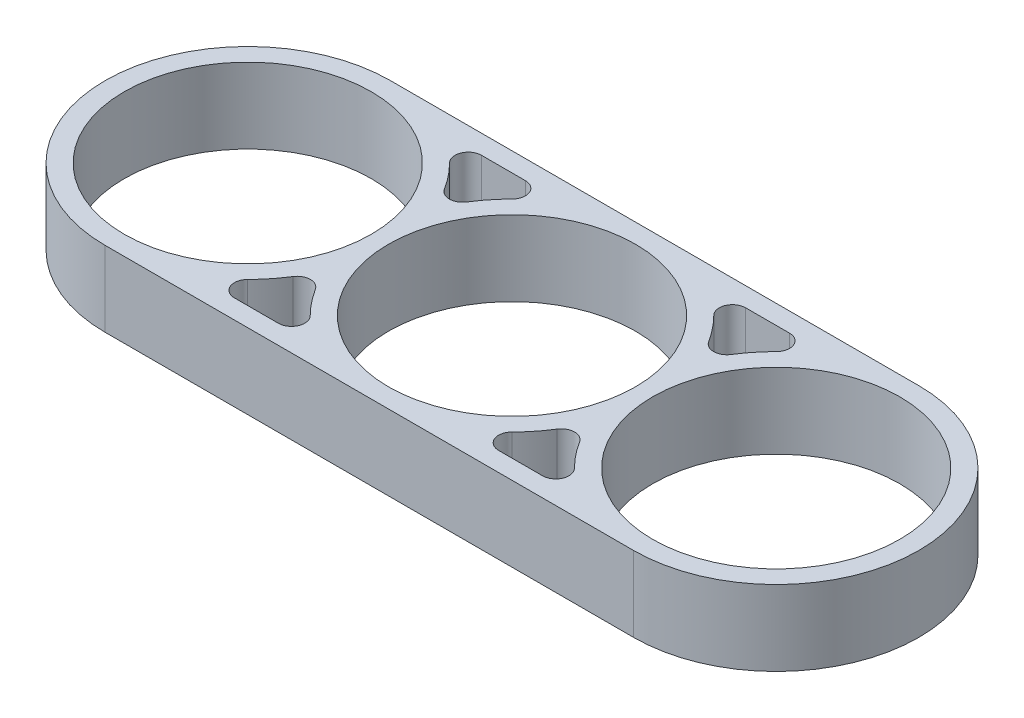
ISO-10303-21;
HEADER;
FILE_DESCRIPTION(('STEP AP214'),'2;1');
FILE_NAME('part.step','',(''),(''),'','','');
FILE_SCHEMA(('AUTOMOTIVE_DESIGN { 1 0 10303 214 1 1 1 1 }'));
ENDSEC;
DATA;
#1=APPLICATION_CONTEXT('core data for automotive mechanical design processes');
#2=APPLICATION_PROTOCOL_DEFINITION('international standard','automotive_design',2000,#1);
#3=PRODUCT_CONTEXT('',#1,'mechanical');
#4=PRODUCT('Part','Part','',(#3));
#5=PRODUCT_RELATED_PRODUCT_CATEGORY('part','',(#4));
#6=PRODUCT_DEFINITION_FORMATION('','',#4);
#7=PRODUCT_DEFINITION_CONTEXT('part definition',#1,'design');
#8=PRODUCT_DEFINITION('design','',#6,#7);
#9=PRODUCT_DEFINITION_SHAPE('','',#8);
#10=(LENGTH_UNIT() NAMED_UNIT(*) SI_UNIT(.MILLI.,.METRE.));
#11=(NAMED_UNIT(*) PLANE_ANGLE_UNIT() SI_UNIT($,.RADIAN.));
#12=(NAMED_UNIT(*) SI_UNIT($,.STERADIAN.) SOLID_ANGLE_UNIT());
#13=UNCERTAINTY_MEASURE_WITH_UNIT(LENGTH_MEASURE(1.E-05),#10,'distance_accuracy_value','');
#14=(GEOMETRIC_REPRESENTATION_CONTEXT(3) GLOBAL_UNCERTAINTY_ASSIGNED_CONTEXT((#13)) GLOBAL_UNIT_ASSIGNED_CONTEXT((#10,
#11,#12)) REPRESENTATION_CONTEXT('',''));
#15=CARTESIAN_POINT('',(0.,0.,0.));
#16=DIRECTION('',(0.,0.,1.));
#17=DIRECTION('',(1.,0.,0.));
#18=AXIS2_PLACEMENT_3D('',#15,#16,#17);
#19=CARTESIAN_POINT('',(-20.,5.7,0.));
#20=DIRECTION('',(0.,1.,0.));
#21=DIRECTION('',(0.,0.,1.));
#22=AXIS2_PLACEMENT_3D('',#19,#20,#21);
#23=PLANE('',#22);
#24=CARTESIAN_POINT('',(0.,5.7,0.));
#25=DIRECTION('',(0.,1.,0.));
#26=DIRECTION('',(0.,0.,1.));
#27=AXIS2_PLACEMENT_3D('',#24,#25,#26);
#28=CIRCLE('',#27,9.35);
#29=CARTESIAN_POINT('',(0.,5.7,9.35));
#30=VERTEX_POINT('',#29);
#31=EDGE_CURVE('E418',#30,#30,#28,.T.);
#32=ORIENTED_EDGE('',*,*,#31,.F.);
#33=EDGE_LOOP('',(#32));
#34=FACE_BOUND('',#33,.T.);
#35=CARTESIAN_POINT('',(-20.,5.7,0.));
#36=DIRECTION('',(0.,1.,0.));
#37=DIRECTION('',(0.,0.,1.));
#38=AXIS2_PLACEMENT_3D('',#35,#36,#37);
#39=CIRCLE('',#38,10.8);
#40=CARTESIAN_POINT('',(-20.,5.7,-10.8));
#41=VERTEX_POINT('',#40);
#42=CARTESIAN_POINT('',(-19.9999999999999,5.7,10.8));
#43=VERTEX_POINT('',#42);
#44=EDGE_CURVE('E430',#41,#43,#39,.T.);
#45=ORIENTED_EDGE('',*,*,#44,.T.);
#46=DIRECTION('',(1.,0.,0.));
#47=VECTOR('',#46,1.);
#48=CARTESIAN_POINT('',(-19.9999999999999,5.7,10.8));
#49=LINE('',#48,#47);
#50=CARTESIAN_POINT('',(20.0000000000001,5.7,10.8));
#51=VERTEX_POINT('',#50);
#52=EDGE_CURVE('E433',#43,#51,#49,.T.);
#53=ORIENTED_EDGE('',*,*,#52,.T.);
#54=CARTESIAN_POINT('',(20.,5.7,0.));
#55=DIRECTION('',(0.,1.,0.));
#56=DIRECTION('',(0.,0.,1.));
#57=AXIS2_PLACEMENT_3D('',#54,#55,#56);
#58=CIRCLE('',#57,10.8);
#59=CARTESIAN_POINT('',(20.,5.7,-10.8));
#60=VERTEX_POINT('',#59);
#61=EDGE_CURVE('E436',#51,#60,#58,.T.);
#62=ORIENTED_EDGE('',*,*,#61,.T.);
#63=DIRECTION('',(-1.,0.,0.));
#64=VECTOR('',#63,1.);
#65=CARTESIAN_POINT('',(-20.,5.7,-10.8));
#66=LINE('',#65,#64);
#67=EDGE_CURVE('E438',#60,#41,#66,.T.);
#68=ORIENTED_EDGE('',*,*,#67,.T.);
#69=EDGE_LOOP('',(#45,#53,#62,#68));
#70=FACE_BOUND('',#69,.T.);
#71=CARTESIAN_POINT('',(-20.,5.7,0.));
#72=DIRECTION('',(0.,1.,0.));
#73=DIRECTION('',(0.,0.,1.));
#74=AXIS2_PLACEMENT_3D('',#71,#72,#73);
#75=CIRCLE('',#74,9.35);
#76=CARTESIAN_POINT('',(-20.,5.7,9.35));
#77=VERTEX_POINT('',#76);
#78=EDGE_CURVE('E424',#77,#77,#75,.T.);
#79=ORIENTED_EDGE('',*,*,#78,.F.);
#80=EDGE_LOOP('',(#79));
#81=FACE_BOUND('',#80,.T.);
#82=CARTESIAN_POINT('',(20.,5.7,0.));
#83=DIRECTION('',(0.,1.,0.));
#84=DIRECTION('',(0.,0.,1.));
#85=AXIS2_PLACEMENT_3D('',#82,#83,#84);
#86=CIRCLE('',#85,9.34999999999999);
#87=CARTESIAN_POINT('',(20.,5.7,9.34999999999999));
#88=VERTEX_POINT('',#87);
#89=EDGE_CURVE('E412',#88,#88,#86,.T.);
#90=ORIENTED_EDGE('',*,*,#89,.F.);
#91=EDGE_LOOP('',(#90));
#92=FACE_BOUND('',#91,.T.);
#93=CARTESIAN_POINT('',(20.,5.7,0.));
#94=DIRECTION('',(0.,-1.,0.));
#95=DIRECTION('',(0.,0.,1.));
#96=AXIS2_PLACEMENT_3D('',#93,#94,#95);
#97=CIRCLE('',#96,10.8);
#98=CARTESIAN_POINT('',(12.3688705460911,5.7,7.64237288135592));
#99=VERTEX_POINT('',#98);
#100=CARTESIAN_POINT('',(10.8474576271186,5.7,5.73332086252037));
#101=VERTEX_POINT('',#100);
#102=EDGE_CURVE('E369',#99,#101,#97,.T.);
#103=ORIENTED_EDGE('',*,*,#102,.F.);
#104=CARTESIAN_POINT('',(11.662284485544,5.7,8.34999999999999));
#105=DIRECTION('',(0.,1.,0.));
#106=DIRECTION('',(0.,0.,1.));
#107=AXIS2_PLACEMENT_3D('',#104,#105,#106);
#108=CIRCLE('',#107,1.);
#109=CARTESIAN_POINT('',(11.662284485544,5.7,9.34999999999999));
#110=VERTEX_POINT('',#109);
#111=EDGE_CURVE('E367',#110,#99,#108,.T.);
#112=ORIENTED_EDGE('',*,*,#111,.F.);
#113=DIRECTION('',(1.,0.,0.));
#114=VECTOR('',#113,1.);
#115=CARTESIAN_POINT('',(8.33771551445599,5.7,9.34999999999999));
#116=LINE('',#115,#114);
#117=CARTESIAN_POINT('',(8.33771551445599,5.7,9.34999999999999));
#118=VERTEX_POINT('',#117);
#119=EDGE_CURVE('E379',#118,#110,#116,.T.);
#120=ORIENTED_EDGE('',*,*,#119,.F.);
#121=CARTESIAN_POINT('',(8.33771551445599,5.7,8.34999999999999));
#122=DIRECTION('',(0.,1.,0.));
#123=DIRECTION('',(0.,0.,-1.));
#124=AXIS2_PLACEMENT_3D('',#121,#122,#123);
#125=CIRCLE('',#124,1.);
#126=CARTESIAN_POINT('',(7.63112945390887,5.7,7.64237288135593));
#127=VERTEX_POINT('',#126);
#128=EDGE_CURVE('E376',#127,#118,#125,.T.);
#129=ORIENTED_EDGE('',*,*,#128,.F.);
#130=CARTESIAN_POINT('',(0.,5.7,0.));
#131=DIRECTION('',(0.,-1.,0.));
#132=DIRECTION('',(0.,0.,1.));
#133=AXIS2_PLACEMENT_3D('',#130,#131,#132);
#134=CIRCLE('',#133,10.8);
#135=CARTESIAN_POINT('',(9.15254237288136,5.7,5.73332086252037));
#136=VERTEX_POINT('',#135);
#137=EDGE_CURVE('E374',#136,#127,#134,.T.);
#138=ORIENTED_EDGE('',*,*,#137,.F.);
#139=CARTESIAN_POINT('',(10.,5.7,6.26418390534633));
#140=DIRECTION('',(0.,1.,0.));
#141=DIRECTION('',(0.,0.,1.));
#142=AXIS2_PLACEMENT_3D('',#139,#140,#141);
#143=CIRCLE('',#142,1.);
#144=EDGE_CURVE('E372',#101,#136,#143,.T.);
#145=ORIENTED_EDGE('',*,*,#144,.F.);
#146=EDGE_LOOP('',(#103,#112,#120,#129,#138,#145));
#147=FACE_BOUND('',#146,.T.);
#148=CARTESIAN_POINT('',(0.,5.7,0.));
#149=DIRECTION('',(0.,-1.,0.));
#150=DIRECTION('',(0.,0.,1.));
#151=AXIS2_PLACEMENT_3D('',#148,#149,#150);
#152=CIRCLE('',#151,10.8);
#153=CARTESIAN_POINT('',(-7.63112945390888,5.7,7.64237288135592));
#154=VERTEX_POINT('',#153);
#155=CARTESIAN_POINT('',(-9.15254237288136,5.7,5.73332086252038));
#156=VERTEX_POINT('',#155);
#157=EDGE_CURVE('E324',#154,#156,#152,.T.);
#158=ORIENTED_EDGE('',*,*,#157,.F.);
#159=CARTESIAN_POINT('',(-8.337715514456,5.7,8.34999999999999));
#160=DIRECTION('',(0.,1.,0.));
#161=DIRECTION('',(0.,0.,1.));
#162=AXIS2_PLACEMENT_3D('',#159,#160,#161);
#163=CIRCLE('',#162,1.);
#164=CARTESIAN_POINT('',(-8.337715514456,5.7,9.34999999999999));
#165=VERTEX_POINT('',#164);
#166=EDGE_CURVE('E322',#165,#154,#163,.T.);
#167=ORIENTED_EDGE('',*,*,#166,.F.);
#168=DIRECTION('',(1.,0.,0.));
#169=VECTOR('',#168,1.);
#170=CARTESIAN_POINT('',(-11.662284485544,5.7,9.35));
#171=LINE('',#170,#169);
#172=CARTESIAN_POINT('',(-11.662284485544,5.7,9.35));
#173=VERTEX_POINT('',#172);
#174=EDGE_CURVE('E334',#173,#165,#171,.T.);
#175=ORIENTED_EDGE('',*,*,#174,.F.);
#176=CARTESIAN_POINT('',(-11.662284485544,5.7,8.35));
#177=DIRECTION('',(0.,1.,0.));
#178=DIRECTION('',(0.,0.,-1.));
#179=AXIS2_PLACEMENT_3D('',#176,#177,#178);
#180=CIRCLE('',#179,1.);
#181=CARTESIAN_POINT('',(-12.3688705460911,5.7,7.64237288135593));
#182=VERTEX_POINT('',#181);
#183=EDGE_CURVE('E331',#182,#173,#180,.T.);
#184=ORIENTED_EDGE('',*,*,#183,.F.);
#185=CARTESIAN_POINT('',(-20.,5.7,0.));
#186=DIRECTION('',(0.,-1.,0.));
#187=DIRECTION('',(0.,0.,1.));
#188=AXIS2_PLACEMENT_3D('',#185,#186,#187);
#189=CIRCLE('',#188,10.8);
#190=CARTESIAN_POINT('',(-10.8474576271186,5.7,5.73332086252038));
#191=VERTEX_POINT('',#190);
#192=EDGE_CURVE('E329',#191,#182,#189,.T.);
#193=ORIENTED_EDGE('',*,*,#192,.F.);
#194=CARTESIAN_POINT('',(-10.,5.7,6.26418390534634));
#195=DIRECTION('',(0.,1.,0.));
#196=DIRECTION('',(0.,0.,-1.));
#197=AXIS2_PLACEMENT_3D('',#194,#195,#196);
#198=CIRCLE('',#197,1.);
#199=EDGE_CURVE('E327',#156,#191,#198,.T.);
#200=ORIENTED_EDGE('',*,*,#199,.F.);
#201=EDGE_LOOP('',(#158,#167,#175,#184,#193,#200));
#202=FACE_BOUND('',#201,.T.);
#203=CARTESIAN_POINT('',(20.,5.7,0.));
#204=DIRECTION('',(0.,-1.,0.));
#205=DIRECTION('',(0.,0.,1.));
#206=AXIS2_PLACEMENT_3D('',#203,#204,#205);
#207=CIRCLE('',#206,10.8);
#208=CARTESIAN_POINT('',(10.8474576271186,5.7,-5.73332086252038));
#209=VERTEX_POINT('',#208);
#210=CARTESIAN_POINT('',(12.3688705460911,5.7,-7.64237288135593));
#211=VERTEX_POINT('',#210);
#212=EDGE_CURVE('E279',#209,#211,#207,.T.);
#213=ORIENTED_EDGE('',*,*,#212,.F.);
#214=CARTESIAN_POINT('',(10.,5.7,-6.26418390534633));
#215=DIRECTION('',(0.,1.,0.));
#216=DIRECTION('',(0.,0.,-1.));
#217=AXIS2_PLACEMENT_3D('',#214,#215,#216);
#218=CIRCLE('',#217,1.);
#219=CARTESIAN_POINT('',(9.15254237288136,5.7,-5.73332086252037));
#220=VERTEX_POINT('',#219);
#221=EDGE_CURVE('E277',#220,#209,#218,.T.);
#222=ORIENTED_EDGE('',*,*,#221,.F.);
#223=CARTESIAN_POINT('',(0.,5.7,0.));
#224=DIRECTION('',(0.,-1.,0.));
#225=DIRECTION('',(0.,0.,1.));
#226=AXIS2_PLACEMENT_3D('',#223,#224,#225);
#227=CIRCLE('',#226,10.8);
#228=CARTESIAN_POINT('',(7.63112945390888,5.7,-7.64237288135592));
#229=VERTEX_POINT('',#228);
#230=EDGE_CURVE('E289',#229,#220,#227,.T.);
#231=ORIENTED_EDGE('',*,*,#230,.F.);
#232=CARTESIAN_POINT('',(8.337715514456,5.7,-8.34999999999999));
#233=DIRECTION('',(0.,1.,0.));
#234=DIRECTION('',(0.,0.,-1.));
#235=AXIS2_PLACEMENT_3D('',#232,#233,#234);
#236=CIRCLE('',#235,1.);
#237=CARTESIAN_POINT('',(8.337715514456,5.7,-9.34999999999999));
#238=VERTEX_POINT('',#237);
#239=EDGE_CURVE('E286',#238,#229,#236,.T.);
#240=ORIENTED_EDGE('',*,*,#239,.F.);
#241=DIRECTION('',(-1.,0.,0.));
#242=VECTOR('',#241,1.);
#243=CARTESIAN_POINT('',(8.337715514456,5.7,-9.34999999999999));
#244=LINE('',#243,#242);
#245=CARTESIAN_POINT('',(11.662284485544,5.7,-9.34999999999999));
#246=VERTEX_POINT('',#245);
#247=EDGE_CURVE('E284',#246,#238,#244,.T.);
#248=ORIENTED_EDGE('',*,*,#247,.F.);
#249=CARTESIAN_POINT('',(11.662284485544,5.7,-8.34999999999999));
#250=DIRECTION('',(0.,1.,0.));
#251=DIRECTION('',(0.,0.,1.));
#252=AXIS2_PLACEMENT_3D('',#249,#250,#251);
#253=CIRCLE('',#252,1.);
#254=EDGE_CURVE('E282',#211,#246,#253,.T.);
#255=ORIENTED_EDGE('',*,*,#254,.F.);
#256=EDGE_LOOP('',(#213,#222,#231,#240,#248,#255));
#257=FACE_BOUND('',#256,.T.);
#258=CARTESIAN_POINT('',(0.,5.7,0.));
#259=DIRECTION('',(0.,-1.,0.));
#260=DIRECTION('',(0.,0.,1.));
#261=AXIS2_PLACEMENT_3D('',#258,#259,#260);
#262=CIRCLE('',#261,10.8);
#263=CARTESIAN_POINT('',(-9.15254237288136,5.7,-5.73332086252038));
#264=VERTEX_POINT('',#263);
#265=CARTESIAN_POINT('',(-7.63112945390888,5.7,-7.64237288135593));
#266=VERTEX_POINT('',#265);
#267=EDGE_CURVE('E234',#264,#266,#262,.T.);
#268=ORIENTED_EDGE('',*,*,#267,.F.);
#269=CARTESIAN_POINT('',(-10.,5.7,-6.26418390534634));
#270=DIRECTION('',(0.,1.,0.));
#271=DIRECTION('',(0.,0.,-1.));
#272=AXIS2_PLACEMENT_3D('',#269,#270,#271);
#273=CIRCLE('',#272,1.);
#274=CARTESIAN_POINT('',(-10.8474576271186,5.7,-5.73332086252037));
#275=VERTEX_POINT('',#274);
#276=EDGE_CURVE('E226',#275,#264,#273,.T.);
#277=ORIENTED_EDGE('',*,*,#276,.F.);
#278=CARTESIAN_POINT('',(-20.,5.7,0.));
#279=DIRECTION('',(0.,-1.,0.));
#280=DIRECTION('',(0.,0.,1.));
#281=AXIS2_PLACEMENT_3D('',#278,#279,#280);
#282=CIRCLE('',#281,10.8);
#283=CARTESIAN_POINT('',(-12.3688705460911,5.7,-7.64237288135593));
#284=VERTEX_POINT('',#283);
#285=EDGE_CURVE('E255',#284,#275,#282,.T.);
#286=ORIENTED_EDGE('',*,*,#285,.F.);
#287=CARTESIAN_POINT('',(-11.662284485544,5.7,-8.35));
#288=DIRECTION('',(0.,1.,0.));
#289=DIRECTION('',(0.,0.,1.));
#290=AXIS2_PLACEMENT_3D('',#287,#288,#289);
#291=CIRCLE('',#290,1.);
#292=CARTESIAN_POINT('',(-11.662284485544,5.7,-9.35));
#293=VERTEX_POINT('',#292);
#294=EDGE_CURVE('E253',#293,#284,#291,.T.);
#295=ORIENTED_EDGE('',*,*,#294,.F.);
#296=DIRECTION('',(-1.,0.,0.));
#297=VECTOR('',#296,1.);
#298=CARTESIAN_POINT('',(-11.662284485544,5.7,-9.35));
#299=LINE('',#298,#297);
#300=CARTESIAN_POINT('',(-8.337715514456,5.7,-9.34999999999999));
#301=VERTEX_POINT('',#300);
#302=EDGE_CURVE('E249',#301,#293,#299,.T.);
#303=ORIENTED_EDGE('',*,*,#302,.F.);
#304=CARTESIAN_POINT('',(-8.337715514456,5.7,-8.34999999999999));
#305=DIRECTION('',(0.,1.,0.));
#306=DIRECTION('',(0.,0.,1.));
#307=AXIS2_PLACEMENT_3D('',#304,#305,#306);
#308=CIRCLE('',#307,1.);
#309=EDGE_CURVE('E247',#266,#301,#308,.T.);
#310=ORIENTED_EDGE('',*,*,#309,.F.);
#311=EDGE_LOOP('',(#268,#277,#286,#295,#303,#310));
#312=FACE_BOUND('',#311,.T.);
#313=ADVANCED_FACE('F41',(#34,#70,#81,#92,#147,#202,#257,#312),#23,.T.);
#314=CARTESIAN_POINT('',(-20.,0.,0.));
#315=DIRECTION('',(0.,1.,0.));
#316=DIRECTION('',(0.,0.,1.));
#317=AXIS2_PLACEMENT_3D('',#314,#315,#316);
#318=PLANE('',#317);
#319=CARTESIAN_POINT('',(10.,0.,-6.26418390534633));
#320=DIRECTION('',(0.,1.,0.));
#321=DIRECTION('',(0.,0.,-1.));
#322=AXIS2_PLACEMENT_3D('',#319,#320,#321);
#323=CIRCLE('',#322,1.);
#324=CARTESIAN_POINT('',(9.15254237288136,0.,-5.73332086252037));
#325=VERTEX_POINT('',#324);
#326=CARTESIAN_POINT('',(10.8474576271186,0.,-5.73332086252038));
#327=VERTEX_POINT('',#326);
#328=EDGE_CURVE('E242',#325,#327,#323,.T.);
#329=ORIENTED_EDGE('',*,*,#328,.T.);
#330=CARTESIAN_POINT('',(20.,0.,0.));
#331=DIRECTION('',(0.,-1.,0.));
#332=DIRECTION('',(0.,0.,1.));
#333=AXIS2_PLACEMENT_3D('',#330,#331,#332);
#334=CIRCLE('',#333,10.8);
#335=CARTESIAN_POINT('',(12.3688705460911,0.,-7.64237288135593));
#336=VERTEX_POINT('',#335);
#337=EDGE_CURVE('E294',#327,#336,#334,.T.);
#338=ORIENTED_EDGE('',*,*,#337,.T.);
#339=CARTESIAN_POINT('',(11.662284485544,0.,-8.34999999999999));
#340=DIRECTION('',(0.,1.,0.));
#341=DIRECTION('',(0.,0.,1.));
#342=AXIS2_PLACEMENT_3D('',#339,#340,#341);
#343=CIRCLE('',#342,1.);
#344=CARTESIAN_POINT('',(11.662284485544,0.,-9.34999999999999));
#345=VERTEX_POINT('',#344);
#346=EDGE_CURVE('E297',#336,#345,#343,.T.);
#347=ORIENTED_EDGE('',*,*,#346,.T.);
#348=DIRECTION('',(-1.,0.,0.));
#349=VECTOR('',#348,1.);
#350=CARTESIAN_POINT('',(8.337715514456,0.,-9.34999999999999));
#351=LINE('',#350,#349);
#352=CARTESIAN_POINT('',(8.337715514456,0.,-9.34999999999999));
#353=VERTEX_POINT('',#352);
#354=EDGE_CURVE('E300',#345,#353,#351,.T.);
#355=ORIENTED_EDGE('',*,*,#354,.T.);
#356=CARTESIAN_POINT('',(8.337715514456,0.,-8.34999999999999));
#357=DIRECTION('',(0.,1.,0.));
#358=DIRECTION('',(0.,0.,-1.));
#359=AXIS2_PLACEMENT_3D('',#356,#357,#358);
#360=CIRCLE('',#359,1.);
#361=CARTESIAN_POINT('',(7.63112945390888,0.,-7.64237288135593));
#362=VERTEX_POINT('',#361);
#363=EDGE_CURVE('E303',#353,#362,#360,.T.);
#364=ORIENTED_EDGE('',*,*,#363,.T.);
#365=CARTESIAN_POINT('',(0.,0.,0.));
#366=DIRECTION('',(0.,-1.,0.));
#367=DIRECTION('',(0.,0.,1.));
#368=AXIS2_PLACEMENT_3D('',#365,#366,#367);
#369=CIRCLE('',#368,10.8);
#370=EDGE_CURVE('E280',#362,#325,#369,.T.);
#371=ORIENTED_EDGE('',*,*,#370,.T.);
#372=EDGE_LOOP('',(#329,#338,#347,#355,#364,#371));
#373=FACE_BOUND('',#372,.T.);
#374=CARTESIAN_POINT('',(11.662284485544,0.,8.34999999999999));
#375=DIRECTION('',(0.,1.,0.));
#376=DIRECTION('',(0.,0.,1.));
#377=AXIS2_PLACEMENT_3D('',#374,#375,#376);
#378=CIRCLE('',#377,1.);
#379=CARTESIAN_POINT('',(11.662284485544,0.,9.34999999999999));
#380=VERTEX_POINT('',#379);
#381=CARTESIAN_POINT('',(12.3688705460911,0.,7.64237288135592));
#382=VERTEX_POINT('',#381);
#383=EDGE_CURVE('E366',#380,#382,#378,.T.);
#384=ORIENTED_EDGE('',*,*,#383,.T.);
#385=CARTESIAN_POINT('',(20.,0.,0.));
#386=DIRECTION('',(0.,-1.,0.));
#387=DIRECTION('',(0.,0.,1.));
#388=AXIS2_PLACEMENT_3D('',#385,#386,#387);
#389=CIRCLE('',#388,10.8);
#390=CARTESIAN_POINT('',(10.8474576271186,0.,5.73332086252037));
#391=VERTEX_POINT('',#390);
#392=EDGE_CURVE('E384',#382,#391,#389,.T.);
#393=ORIENTED_EDGE('',*,*,#392,.T.);
#394=CARTESIAN_POINT('',(10.,0.,6.26418390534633));
#395=DIRECTION('',(0.,1.,0.));
#396=DIRECTION('',(0.,0.,1.));
#397=AXIS2_PLACEMENT_3D('',#394,#395,#396);
#398=CIRCLE('',#397,1.);
#399=CARTESIAN_POINT('',(9.15254237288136,0.,5.73332086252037));
#400=VERTEX_POINT('',#399);
#401=EDGE_CURVE('E387',#391,#400,#398,.T.);
#402=ORIENTED_EDGE('',*,*,#401,.T.);
#403=CARTESIAN_POINT('',(0.,0.,0.));
#404=DIRECTION('',(0.,-1.,0.));
#405=DIRECTION('',(0.,0.,1.));
#406=AXIS2_PLACEMENT_3D('',#403,#404,#405);
#407=CIRCLE('',#406,10.8);
#408=CARTESIAN_POINT('',(7.63112945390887,0.,7.64237288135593));
#409=VERTEX_POINT('',#408);
#410=EDGE_CURVE('E390',#400,#409,#407,.T.);
#411=ORIENTED_EDGE('',*,*,#410,.T.);
#412=CARTESIAN_POINT('',(8.33771551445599,0.,8.34999999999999));
#413=DIRECTION('',(0.,1.,0.));
#414=DIRECTION('',(0.,0.,-1.));
#415=AXIS2_PLACEMENT_3D('',#412,#413,#414);
#416=CIRCLE('',#415,1.);
#417=CARTESIAN_POINT('',(8.33771551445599,0.,9.34999999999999));
#418=VERTEX_POINT('',#417);
#419=EDGE_CURVE('E393',#409,#418,#416,.T.);
#420=ORIENTED_EDGE('',*,*,#419,.T.);
#421=DIRECTION('',(1.,0.,0.));
#422=VECTOR('',#421,1.);
#423=CARTESIAN_POINT('',(8.33771551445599,0.,9.34999999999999));
#424=LINE('',#423,#422);
#425=EDGE_CURVE('E370',#418,#380,#424,.T.);
#426=ORIENTED_EDGE('',*,*,#425,.T.);
#427=EDGE_LOOP('',(#384,#393,#402,#411,#420,#426));
#428=FACE_BOUND('',#427,.T.);
#429=CARTESIAN_POINT('',(-20.,0.,0.));
#430=DIRECTION('',(0.,1.,0.));
#431=DIRECTION('',(0.,0.,1.));
#432=AXIS2_PLACEMENT_3D('',#429,#430,#431);
#433=CIRCLE('',#432,10.8);
#434=CARTESIAN_POINT('',(-20.,0.,-10.8));
#435=VERTEX_POINT('',#434);
#436=CARTESIAN_POINT('',(-19.9999999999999,0.,10.8));
#437=VERTEX_POINT('',#436);
#438=EDGE_CURVE('E427',#435,#437,#433,.T.);
#439=ORIENTED_EDGE('',*,*,#438,.F.);
#440=DIRECTION('',(-1.,0.,0.));
#441=VECTOR('',#440,1.);
#442=CARTESIAN_POINT('',(-20.,0.,-10.8));
#443=LINE('',#442,#441);
#444=CARTESIAN_POINT('',(20.,0.,-10.8));
#445=VERTEX_POINT('',#444);
#446=EDGE_CURVE('E434',#445,#435,#443,.T.);
#447=ORIENTED_EDGE('',*,*,#446,.F.);
#448=CARTESIAN_POINT('',(20.,0.,0.));
#449=DIRECTION('',(0.,1.,0.));
#450=DIRECTION('',(0.,0.,1.));
#451=AXIS2_PLACEMENT_3D('',#448,#449,#450);
#452=CIRCLE('',#451,10.8);
#453=CARTESIAN_POINT('',(20.0000000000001,0.,10.8));
#454=VERTEX_POINT('',#453);
#455=EDGE_CURVE('E445',#454,#445,#452,.T.);
#456=ORIENTED_EDGE('',*,*,#455,.F.);
#457=DIRECTION('',(1.,0.,0.));
#458=VECTOR('',#457,1.);
#459=CARTESIAN_POINT('',(-19.9999999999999,0.,10.8));
#460=LINE('',#459,#458);
#461=EDGE_CURVE('E443',#437,#454,#460,.T.);
#462=ORIENTED_EDGE('',*,*,#461,.F.);
#463=EDGE_LOOP('',(#439,#447,#456,#462));
#464=FACE_BOUND('',#463,.T.);
#465=CARTESIAN_POINT('',(-20.,0.,0.));
#466=DIRECTION('',(0.,1.,0.));
#467=DIRECTION('',(0.,0.,1.));
#468=AXIS2_PLACEMENT_3D('',#465,#466,#467);
#469=CIRCLE('',#468,9.35);
#470=CARTESIAN_POINT('',(-20.,0.,9.35));
#471=VERTEX_POINT('',#470);
#472=EDGE_CURVE('E421',#471,#471,#469,.T.);
#473=ORIENTED_EDGE('',*,*,#472,.T.);
#474=EDGE_LOOP('',(#473));
#475=FACE_BOUND('',#474,.T.);
#476=CARTESIAN_POINT('',(0.,0.,0.));
#477=DIRECTION('',(0.,1.,0.));
#478=DIRECTION('',(0.,0.,1.));
#479=AXIS2_PLACEMENT_3D('',#476,#477,#478);
#480=CIRCLE('',#479,9.35);
#481=CARTESIAN_POINT('',(0.,0.,9.35));
#482=VERTEX_POINT('',#481);
#483=EDGE_CURVE('E415',#482,#482,#480,.T.);
#484=ORIENTED_EDGE('',*,*,#483,.T.);
#485=EDGE_LOOP('',(#484));
#486=FACE_BOUND('',#485,.T.);
#487=CARTESIAN_POINT('',(20.,0.,0.));
#488=DIRECTION('',(0.,1.,0.));
#489=DIRECTION('',(0.,0.,1.));
#490=AXIS2_PLACEMENT_3D('',#487,#488,#489);
#491=CIRCLE('',#490,9.34999999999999);
#492=CARTESIAN_POINT('',(20.,0.,9.34999999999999));
#493=VERTEX_POINT('',#492);
#494=EDGE_CURVE('E411',#493,#493,#491,.T.);
#495=ORIENTED_EDGE('',*,*,#494,.T.);
#496=EDGE_LOOP('',(#495));
#497=FACE_BOUND('',#496,.T.);
#498=CARTESIAN_POINT('',(-8.337715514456,0.,8.34999999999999));
#499=DIRECTION('',(0.,1.,0.));
#500=DIRECTION('',(0.,0.,1.));
#501=AXIS2_PLACEMENT_3D('',#498,#499,#500);
#502=CIRCLE('',#501,1.);
#503=CARTESIAN_POINT('',(-8.337715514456,0.,9.34999999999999));
#504=VERTEX_POINT('',#503);
#505=CARTESIAN_POINT('',(-7.63112945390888,0.,7.64237288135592));
#506=VERTEX_POINT('',#505);
#507=EDGE_CURVE('E321',#504,#506,#502,.T.);
#508=ORIENTED_EDGE('',*,*,#507,.T.);
#509=CARTESIAN_POINT('',(0.,0.,0.));
#510=DIRECTION('',(0.,-1.,0.));
#511=DIRECTION('',(0.,0.,1.));
#512=AXIS2_PLACEMENT_3D('',#509,#510,#511);
#513=CIRCLE('',#512,10.8);
#514=CARTESIAN_POINT('',(-9.15254237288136,0.,5.73332086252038));
#515=VERTEX_POINT('',#514);
#516=EDGE_CURVE('E339',#506,#515,#513,.T.);
#517=ORIENTED_EDGE('',*,*,#516,.T.);
#518=CARTESIAN_POINT('',(-10.,0.,6.26418390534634));
#519=DIRECTION('',(0.,1.,0.));
#520=DIRECTION('',(0.,0.,-1.));
#521=AXIS2_PLACEMENT_3D('',#518,#519,#520);
#522=CIRCLE('',#521,1.);
#523=CARTESIAN_POINT('',(-10.8474576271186,0.,5.73332086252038));
#524=VERTEX_POINT('',#523);
#525=EDGE_CURVE('E342',#515,#524,#522,.T.);
#526=ORIENTED_EDGE('',*,*,#525,.T.);
#527=CARTESIAN_POINT('',(-20.,0.,0.));
#528=DIRECTION('',(0.,-1.,0.));
#529=DIRECTION('',(0.,0.,1.));
#530=AXIS2_PLACEMENT_3D('',#527,#528,#529);
#531=CIRCLE('',#530,10.8);
#532=CARTESIAN_POINT('',(-12.3688705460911,0.,7.64237288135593));
#533=VERTEX_POINT('',#532);
#534=EDGE_CURVE('E345',#524,#533,#531,.T.);
#535=ORIENTED_EDGE('',*,*,#534,.T.);
#536=CARTESIAN_POINT('',(-11.662284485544,0.,8.35));
#537=DIRECTION('',(0.,1.,0.));
#538=DIRECTION('',(0.,0.,-1.));
#539=AXIS2_PLACEMENT_3D('',#536,#537,#538);
#540=CIRCLE('',#539,1.);
#541=CARTESIAN_POINT('',(-11.662284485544,0.,9.35));
#542=VERTEX_POINT('',#541);
#543=EDGE_CURVE('E348',#533,#542,#540,.T.);
#544=ORIENTED_EDGE('',*,*,#543,.T.);
#545=DIRECTION('',(1.,0.,0.));
#546=VECTOR('',#545,1.);
#547=CARTESIAN_POINT('',(-11.662284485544,0.,9.35));
#548=LINE('',#547,#546);
#549=EDGE_CURVE('E325',#542,#504,#548,.T.);
#550=ORIENTED_EDGE('',*,*,#549,.T.);
#551=EDGE_LOOP('',(#508,#517,#526,#535,#544,#550));
#552=FACE_BOUND('',#551,.T.);
#553=CARTESIAN_POINT('',(-10.,0.,-6.26418390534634));
#554=DIRECTION('',(0.,1.,0.));
#555=DIRECTION('',(0.,0.,-1.));
#556=AXIS2_PLACEMENT_3D('',#553,#554,#555);
#557=CIRCLE('',#556,1.);
#558=CARTESIAN_POINT('',(-10.8474576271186,0.,-5.73332086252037));
#559=VERTEX_POINT('',#558);
#560=CARTESIAN_POINT('',(-9.15254237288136,0.,-5.73332086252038));
#561=VERTEX_POINT('',#560);
#562=EDGE_CURVE('E64',#559,#561,#557,.T.);
#563=ORIENTED_EDGE('',*,*,#562,.T.);
#564=CARTESIAN_POINT('',(0.,0.,0.));
#565=DIRECTION('',(0.,-1.,0.));
#566=DIRECTION('',(0.,0.,1.));
#567=AXIS2_PLACEMENT_3D('',#564,#565,#566);
#568=CIRCLE('',#567,10.8);
#569=CARTESIAN_POINT('',(-7.63112945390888,0.,-7.64237288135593));
#570=VERTEX_POINT('',#569);
#571=EDGE_CURVE('E241',#561,#570,#568,.T.);
#572=ORIENTED_EDGE('',*,*,#571,.T.);
#573=CARTESIAN_POINT('',(-8.337715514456,0.,-8.34999999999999));
#574=DIRECTION('',(0.,1.,0.));
#575=DIRECTION('',(0.,0.,1.));
#576=AXIS2_PLACEMENT_3D('',#573,#574,#575);
#577=CIRCLE('',#576,1.);
#578=CARTESIAN_POINT('',(-8.337715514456,0.,-9.34999999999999));
#579=VERTEX_POINT('',#578);
#580=EDGE_CURVE('E259',#570,#579,#577,.T.);
#581=ORIENTED_EDGE('',*,*,#580,.T.);
#582=DIRECTION('',(-1.,0.,0.));
#583=VECTOR('',#582,1.);
#584=CARTESIAN_POINT('',(-11.662284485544,0.,-9.35));
#585=LINE('',#584,#583);
#586=CARTESIAN_POINT('',(-11.662284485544,0.,-9.35));
#587=VERTEX_POINT('',#586);
#588=EDGE_CURVE('E262',#579,#587,#585,.T.);
#589=ORIENTED_EDGE('',*,*,#588,.T.);
#590=CARTESIAN_POINT('',(-11.662284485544,0.,-8.35));
#591=DIRECTION('',(0.,1.,0.));
#592=DIRECTION('',(0.,0.,1.));
#593=AXIS2_PLACEMENT_3D('',#590,#591,#592);
#594=CIRCLE('',#593,1.);
#595=CARTESIAN_POINT('',(-12.3688705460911,0.,-7.64237288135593));
#596=VERTEX_POINT('',#595);
#597=EDGE_CURVE('E265',#587,#596,#594,.T.);
#598=ORIENTED_EDGE('',*,*,#597,.T.);
#599=CARTESIAN_POINT('',(-20.,0.,0.));
#600=DIRECTION('',(0.,-1.,0.));
#601=DIRECTION('',(0.,0.,1.));
#602=AXIS2_PLACEMENT_3D('',#599,#600,#601);
#603=CIRCLE('',#602,10.8);
#604=EDGE_CURVE('E235',#596,#559,#603,.T.);
#605=ORIENTED_EDGE('',*,*,#604,.T.);
#606=EDGE_LOOP('',(#563,#572,#581,#589,#598,#605));
#607=FACE_BOUND('',#606,.T.);
#608=ADVANCED_FACE('F463',(#373,#428,#464,#475,#486,#497,#552,#607),#318,.F.);
#609=CARTESIAN_POINT('',(-20.,5.7,0.));
#610=DIRECTION('',(0.,-1.,0.));
#611=DIRECTION('',(0.,0.,-1.));
#612=AXIS2_PLACEMENT_3D('',#609,#610,#611);
#613=CYLINDRICAL_SURFACE('',#612,10.8);
#614=ORIENTED_EDGE('',*,*,#438,.T.);
#615=DIRECTION('',(0.,-1.,0.));
#616=VECTOR('',#615,1.);
#617=CARTESIAN_POINT('',(-19.9999999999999,5.7,10.8));
#618=LINE('',#617,#616);
#619=EDGE_CURVE('E11',#43,#437,#618,.T.);
#620=ORIENTED_EDGE('',*,*,#619,.F.);
#621=ORIENTED_EDGE('',*,*,#44,.F.);
#622=DIRECTION('',(0.,-1.,0.));
#623=VECTOR('',#622,1.);
#624=CARTESIAN_POINT('',(-20.,5.7,-10.8));
#625=LINE('',#624,#623);
#626=EDGE_CURVE('E440',#41,#435,#625,.T.);
#627=ORIENTED_EDGE('',*,*,#626,.T.);
#628=EDGE_LOOP('',(#614,#620,#621,#627));
#629=FACE_BOUND('',#628,.T.);
#630=ADVANCED_FACE('F43',(#629),#613,.T.);
#631=CARTESIAN_POINT('',(-19.9999999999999,5.7,10.8));
#632=DIRECTION('',(0.,0.,-1.));
#633=DIRECTION('',(-1.,0.,0.));
#634=AXIS2_PLACEMENT_3D('',#631,#632,#633);
#635=PLANE('',#634);
#636=ORIENTED_EDGE('',*,*,#461,.T.);
#637=DIRECTION('',(0.,-1.,0.));
#638=VECTOR('',#637,1.);
#639=CARTESIAN_POINT('',(20.0000000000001,5.7,10.8));
#640=LINE('',#639,#638);
#641=EDGE_CURVE('E49',#51,#454,#640,.T.);
#642=ORIENTED_EDGE('',*,*,#641,.F.);
#643=ORIENTED_EDGE('',*,*,#52,.F.);
#644=ORIENTED_EDGE('',*,*,#619,.T.);
#645=EDGE_LOOP('',(#636,#642,#643,#644));
#646=FACE_BOUND('',#645,.T.);
#647=ADVANCED_FACE('F474',(#646),#635,.F.);
#648=CARTESIAN_POINT('',(20.,5.7,0.));
#649=DIRECTION('',(0.,-1.,0.));
#650=DIRECTION('',(0.,0.,-1.));
#651=AXIS2_PLACEMENT_3D('',#648,#649,#650);
#652=CYLINDRICAL_SURFACE('',#651,10.8);
#653=ORIENTED_EDGE('',*,*,#455,.T.);
#654=DIRECTION('',(0.,-1.,0.));
#655=VECTOR('',#654,1.);
#656=CARTESIAN_POINT('',(20.,5.7,-10.8));
#657=LINE('',#656,#655);
#658=EDGE_CURVE('E450',#60,#445,#657,.T.);
#659=ORIENTED_EDGE('',*,*,#658,.F.);
#660=ORIENTED_EDGE('',*,*,#61,.F.);
#661=ORIENTED_EDGE('',*,*,#641,.T.);
#662=EDGE_LOOP('',(#653,#659,#660,#661));
#663=FACE_BOUND('',#662,.T.);
#664=ADVANCED_FACE('F457',(#663),#652,.T.);
#665=CARTESIAN_POINT('',(-20.,5.7,-10.8));
#666=DIRECTION('',(0.,0.,1.));
#667=DIRECTION('',(1.,0.,0.));
#668=AXIS2_PLACEMENT_3D('',#665,#666,#667);
#669=PLANE('',#668);
#670=ORIENTED_EDGE('',*,*,#446,.T.);
#671=ORIENTED_EDGE('',*,*,#626,.F.);
#672=ORIENTED_EDGE('',*,*,#67,.F.);
#673=ORIENTED_EDGE('',*,*,#658,.T.);
#674=EDGE_LOOP('',(#670,#671,#672,#673));
#675=FACE_BOUND('',#674,.T.);
#676=ADVANCED_FACE('F467',(#675),#669,.F.);
#677=CARTESIAN_POINT('',(-20.,5.7,0.));
#678=DIRECTION('',(0.,-1.,0.));
#679=DIRECTION('',(0.,0.,-1.));
#680=AXIS2_PLACEMENT_3D('',#677,#678,#679);
#681=CYLINDRICAL_SURFACE('',#680,9.35);
#682=ORIENTED_EDGE('',*,*,#78,.T.);
#683=EDGE_LOOP('',(#682));
#684=FACE_BOUND('',#683,.T.);
#685=ORIENTED_EDGE('',*,*,#472,.F.);
#686=EDGE_LOOP('',(#685));
#687=FACE_BOUND('',#686,.T.);
#688=ADVANCED_FACE('F491',(#684,#687),#681,.F.);
#689=CARTESIAN_POINT('',(0.,5.7,0.));
#690=DIRECTION('',(0.,-1.,0.));
#691=DIRECTION('',(0.,0.,-1.));
#692=AXIS2_PLACEMENT_3D('',#689,#690,#691);
#693=CYLINDRICAL_SURFACE('',#692,9.35);
#694=ORIENTED_EDGE('',*,*,#31,.T.);
#695=EDGE_LOOP('',(#694));
#696=FACE_BOUND('',#695,.T.);
#697=ORIENTED_EDGE('',*,*,#483,.F.);
#698=EDGE_LOOP('',(#697));
#699=FACE_BOUND('',#698,.T.);
#700=ADVANCED_FACE('F498',(#696,#699),#693,.F.);
#701=CARTESIAN_POINT('',(20.,5.7,0.));
#702=DIRECTION('',(0.,-1.,0.));
#703=DIRECTION('',(0.,0.,-1.));
#704=AXIS2_PLACEMENT_3D('',#701,#702,#703);
#705=CYLINDRICAL_SURFACE('',#704,9.34999999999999);
#706=ORIENTED_EDGE('',*,*,#89,.T.);
#707=EDGE_LOOP('',(#706));
#708=FACE_BOUND('',#707,.T.);
#709=ORIENTED_EDGE('',*,*,#494,.F.);
#710=EDGE_LOOP('',(#709));
#711=FACE_BOUND('',#710,.T.);
#712=ADVANCED_FACE('F503',(#708,#711),#705,.F.);
#713=CARTESIAN_POINT('',(11.662284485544,5.7,8.34999999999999));
#714=DIRECTION('',(0.,-1.,0.));
#715=DIRECTION('',(0.,0.,-1.));
#716=AXIS2_PLACEMENT_3D('',#713,#714,#715);
#717=CYLINDRICAL_SURFACE('',#716,1.);
#718=ORIENTED_EDGE('',*,*,#383,.F.);
#719=DIRECTION('',(0.,-1.,0.));
#720=VECTOR('',#719,1.);
#721=CARTESIAN_POINT('',(11.662284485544,5.7,9.34999999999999));
#722=LINE('',#721,#720);
#723=EDGE_CURVE('E381',#110,#380,#722,.T.);
#724=ORIENTED_EDGE('',*,*,#723,.F.);
#725=ORIENTED_EDGE('',*,*,#111,.T.);
#726=DIRECTION('',(0.,-1.,0.));
#727=VECTOR('',#726,1.);
#728=CARTESIAN_POINT('',(12.3688705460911,5.7,7.64237288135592));
#729=LINE('',#728,#727);
#730=EDGE_CURVE('E408',#99,#382,#729,.T.);
#731=ORIENTED_EDGE('',*,*,#730,.T.);
#732=EDGE_LOOP('',(#718,#724,#725,#731));
#733=FACE_BOUND('',#732,.T.);
#734=ADVANCED_FACE('F606',(#733),#717,.F.);
#735=CARTESIAN_POINT('',(20.,5.7,0.));
#736=DIRECTION('',(0.,-1.,0.));
#737=DIRECTION('',(0.,0.,-1.));
#738=AXIS2_PLACEMENT_3D('',#735,#736,#737);
#739=CYLINDRICAL_SURFACE('',#738,10.8);
#740=ORIENTED_EDGE('',*,*,#392,.F.);
#741=ORIENTED_EDGE('',*,*,#730,.F.);
#742=ORIENTED_EDGE('',*,*,#102,.T.);
#743=DIRECTION('',(0.,-1.,0.));
#744=VECTOR('',#743,1.);
#745=CARTESIAN_POINT('',(10.8474576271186,5.7,5.73332086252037));
#746=LINE('',#745,#744);
#747=EDGE_CURVE('E406',#101,#391,#746,.T.);
#748=ORIENTED_EDGE('',*,*,#747,.T.);
#749=EDGE_LOOP('',(#740,#741,#742,#748));
#750=FACE_BOUND('',#749,.T.);
#751=ADVANCED_FACE('F602',(#750),#739,.T.);
#752=CARTESIAN_POINT('',(10.,5.7,6.26418390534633));
#753=DIRECTION('',(0.,-1.,0.));
#754=DIRECTION('',(0.,0.,-1.));
#755=AXIS2_PLACEMENT_3D('',#752,#753,#754);
#756=CYLINDRICAL_SURFACE('',#755,1.);
#757=ORIENTED_EDGE('',*,*,#401,.F.);
#758=ORIENTED_EDGE('',*,*,#747,.F.);
#759=ORIENTED_EDGE('',*,*,#144,.T.);
#760=DIRECTION('',(0.,-1.,0.));
#761=VECTOR('',#760,1.);
#762=CARTESIAN_POINT('',(9.15254237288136,5.7,5.73332086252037));
#763=LINE('',#762,#761);
#764=EDGE_CURVE('E404',#136,#400,#763,.T.);
#765=ORIENTED_EDGE('',*,*,#764,.T.);
#766=EDGE_LOOP('',(#757,#758,#759,#765));
#767=FACE_BOUND('',#766,.T.);
#768=ADVANCED_FACE('F598',(#767),#756,.F.);
#769=CARTESIAN_POINT('',(0.,5.7,0.));
#770=DIRECTION('',(0.,-1.,0.));
#771=DIRECTION('',(0.,0.,-1.));
#772=AXIS2_PLACEMENT_3D('',#769,#770,#771);
#773=CYLINDRICAL_SURFACE('',#772,10.8);
#774=ORIENTED_EDGE('',*,*,#410,.F.);
#775=ORIENTED_EDGE('',*,*,#764,.F.);
#776=ORIENTED_EDGE('',*,*,#137,.T.);
#777=DIRECTION('',(0.,-1.,0.));
#778=VECTOR('',#777,1.);
#779=CARTESIAN_POINT('',(7.63112945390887,5.7,7.64237288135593));
#780=LINE('',#779,#778);
#781=EDGE_CURVE('E402',#127,#409,#780,.T.);
#782=ORIENTED_EDGE('',*,*,#781,.T.);
#783=EDGE_LOOP('',(#774,#775,#776,#782));
#784=FACE_BOUND('',#783,.T.);
#785=ADVANCED_FACE('F594',(#784),#773,.T.);
#786=CARTESIAN_POINT('',(8.33771551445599,5.7,8.34999999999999));
#787=DIRECTION('',(0.,-1.,0.));
#788=DIRECTION('',(0.,0.,-1.));
#789=AXIS2_PLACEMENT_3D('',#786,#787,#788);
#790=CYLINDRICAL_SURFACE('',#789,1.);
#791=ORIENTED_EDGE('',*,*,#419,.F.);
#792=ORIENTED_EDGE('',*,*,#781,.F.);
#793=ORIENTED_EDGE('',*,*,#128,.T.);
#794=DIRECTION('',(0.,-1.,0.));
#795=VECTOR('',#794,1.);
#796=CARTESIAN_POINT('',(8.33771551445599,5.7,9.34999999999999));
#797=LINE('',#796,#795);
#798=EDGE_CURVE('E400',#118,#418,#797,.T.);
#799=ORIENTED_EDGE('',*,*,#798,.T.);
#800=EDGE_LOOP('',(#791,#792,#793,#799));
#801=FACE_BOUND('',#800,.T.);
#802=ADVANCED_FACE('F590',(#801),#790,.F.);
#803=CARTESIAN_POINT('',(8.33771551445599,5.7,9.34999999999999));
#804=DIRECTION('',(0.,0.,-1.));
#805=DIRECTION('',(-1.,0.,0.));
#806=AXIS2_PLACEMENT_3D('',#803,#804,#805);
#807=PLANE('',#806);
#808=ORIENTED_EDGE('',*,*,#425,.F.);
#809=ORIENTED_EDGE('',*,*,#798,.F.);
#810=ORIENTED_EDGE('',*,*,#119,.T.);
#811=ORIENTED_EDGE('',*,*,#723,.T.);
#812=EDGE_LOOP('',(#808,#809,#810,#811));
#813=FACE_BOUND('',#812,.T.);
#814=ADVANCED_FACE('F586',(#813),#807,.T.);
#815=CARTESIAN_POINT('',(-8.337715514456,5.7,8.34999999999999));
#816=DIRECTION('',(0.,-1.,0.));
#817=DIRECTION('',(0.,0.,-1.));
#818=AXIS2_PLACEMENT_3D('',#815,#816,#817);
#819=CYLINDRICAL_SURFACE('',#818,1.);
#820=ORIENTED_EDGE('',*,*,#507,.F.);
#821=DIRECTION('',(0.,-1.,0.));
#822=VECTOR('',#821,1.);
#823=CARTESIAN_POINT('',(-8.337715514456,5.7,9.34999999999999));
#824=LINE('',#823,#822);
#825=EDGE_CURVE('E336',#165,#504,#824,.T.);
#826=ORIENTED_EDGE('',*,*,#825,.F.);
#827=ORIENTED_EDGE('',*,*,#166,.T.);
#828=DIRECTION('',(0.,-1.,0.));
#829=VECTOR('',#828,1.);
#830=CARTESIAN_POINT('',(-7.63112945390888,5.7,7.64237288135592));
#831=LINE('',#830,#829);
#832=EDGE_CURVE('E363',#154,#506,#831,.T.);
#833=ORIENTED_EDGE('',*,*,#832,.T.);
#834=EDGE_LOOP('',(#820,#826,#827,#833));
#835=FACE_BOUND('',#834,.T.);
#836=ADVANCED_FACE('F582',(#835),#819,.F.);
#837=CARTESIAN_POINT('',(0.,5.7,0.));
#838=DIRECTION('',(0.,-1.,0.));
#839=DIRECTION('',(0.,0.,-1.));
#840=AXIS2_PLACEMENT_3D('',#837,#838,#839);
#841=CYLINDRICAL_SURFACE('',#840,10.8);
#842=ORIENTED_EDGE('',*,*,#516,.F.);
#843=ORIENTED_EDGE('',*,*,#832,.F.);
#844=ORIENTED_EDGE('',*,*,#157,.T.);
#845=DIRECTION('',(0.,-1.,0.));
#846=VECTOR('',#845,1.);
#847=CARTESIAN_POINT('',(-9.15254237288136,5.7,5.73332086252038));
#848=LINE('',#847,#846);
#849=EDGE_CURVE('E361',#156,#515,#848,.T.);
#850=ORIENTED_EDGE('',*,*,#849,.T.);
#851=EDGE_LOOP('',(#842,#843,#844,#850));
#852=FACE_BOUND('',#851,.T.);
#853=ADVANCED_FACE('F578',(#852),#841,.T.);
#854=CARTESIAN_POINT('',(-10.,5.7,6.26418390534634));
#855=DIRECTION('',(0.,-1.,0.));
#856=DIRECTION('',(0.,0.,-1.));
#857=AXIS2_PLACEMENT_3D('',#854,#855,#856);
#858=CYLINDRICAL_SURFACE('',#857,1.);
#859=ORIENTED_EDGE('',*,*,#525,.F.);
#860=ORIENTED_EDGE('',*,*,#849,.F.);
#861=ORIENTED_EDGE('',*,*,#199,.T.);
#862=DIRECTION('',(0.,-1.,0.));
#863=VECTOR('',#862,1.);
#864=CARTESIAN_POINT('',(-10.8474576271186,5.7,5.73332086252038));
#865=LINE('',#864,#863);
#866=EDGE_CURVE('E359',#191,#524,#865,.T.);
#867=ORIENTED_EDGE('',*,*,#866,.T.);
#868=EDGE_LOOP('',(#859,#860,#861,#867));
#869=FACE_BOUND('',#868,.T.);
#870=ADVANCED_FACE('F574',(#869),#858,.F.);
#871=CARTESIAN_POINT('',(-20.,5.7,0.));
#872=DIRECTION('',(0.,-1.,0.));
#873=DIRECTION('',(0.,0.,-1.));
#874=AXIS2_PLACEMENT_3D('',#871,#872,#873);
#875=CYLINDRICAL_SURFACE('',#874,10.8);
#876=ORIENTED_EDGE('',*,*,#534,.F.);
#877=ORIENTED_EDGE('',*,*,#866,.F.);
#878=ORIENTED_EDGE('',*,*,#192,.T.);
#879=DIRECTION('',(0.,-1.,0.));
#880=VECTOR('',#879,1.);
#881=CARTESIAN_POINT('',(-12.3688705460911,5.7,7.64237288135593));
#882=LINE('',#881,#880);
#883=EDGE_CURVE('E357',#182,#533,#882,.T.);
#884=ORIENTED_EDGE('',*,*,#883,.T.);
#885=EDGE_LOOP('',(#876,#877,#878,#884));
#886=FACE_BOUND('',#885,.T.);
#887=ADVANCED_FACE('F570',(#886),#875,.T.);
#888=CARTESIAN_POINT('',(-11.662284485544,5.7,8.35));
#889=DIRECTION('',(0.,-1.,0.));
#890=DIRECTION('',(0.,0.,-1.));
#891=AXIS2_PLACEMENT_3D('',#888,#889,#890);
#892=CYLINDRICAL_SURFACE('',#891,1.);
#893=ORIENTED_EDGE('',*,*,#543,.F.);
#894=ORIENTED_EDGE('',*,*,#883,.F.);
#895=ORIENTED_EDGE('',*,*,#183,.T.);
#896=DIRECTION('',(0.,-1.,0.));
#897=VECTOR('',#896,1.);
#898=CARTESIAN_POINT('',(-11.662284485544,5.7,9.35));
#899=LINE('',#898,#897);
#900=EDGE_CURVE('E355',#173,#542,#899,.T.);
#901=ORIENTED_EDGE('',*,*,#900,.T.);
#902=EDGE_LOOP('',(#893,#894,#895,#901));
#903=FACE_BOUND('',#902,.T.);
#904=ADVANCED_FACE('F566',(#903),#892,.F.);
#905=CARTESIAN_POINT('',(-11.662284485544,5.7,9.35));
#906=DIRECTION('',(0.,0.,-1.));
#907=DIRECTION('',(-1.,0.,0.));
#908=AXIS2_PLACEMENT_3D('',#905,#906,#907);
#909=PLANE('',#908);
#910=ORIENTED_EDGE('',*,*,#549,.F.);
#911=ORIENTED_EDGE('',*,*,#900,.F.);
#912=ORIENTED_EDGE('',*,*,#174,.T.);
#913=ORIENTED_EDGE('',*,*,#825,.T.);
#914=EDGE_LOOP('',(#910,#911,#912,#913));
#915=FACE_BOUND('',#914,.T.);
#916=ADVANCED_FACE('F562',(#915),#909,.T.);
#917=CARTESIAN_POINT('',(10.,5.7,-6.26418390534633));
#918=DIRECTION('',(0.,-1.,0.));
#919=DIRECTION('',(0.,0.,-1.));
#920=AXIS2_PLACEMENT_3D('',#917,#918,#919);
#921=CYLINDRICAL_SURFACE('',#920,1.);
#922=ORIENTED_EDGE('',*,*,#328,.F.);
#923=DIRECTION('',(0.,-1.,0.));
#924=VECTOR('',#923,1.);
#925=CARTESIAN_POINT('',(9.15254237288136,5.7,-5.73332086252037));
#926=LINE('',#925,#924);
#927=EDGE_CURVE('E291',#220,#325,#926,.T.);
#928=ORIENTED_EDGE('',*,*,#927,.F.);
#929=ORIENTED_EDGE('',*,*,#221,.T.);
#930=DIRECTION('',(0.,-1.,0.));
#931=VECTOR('',#930,1.);
#932=CARTESIAN_POINT('',(10.8474576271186,5.7,-5.73332086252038));
#933=LINE('',#932,#931);
#934=EDGE_CURVE('E318',#209,#327,#933,.T.);
#935=ORIENTED_EDGE('',*,*,#934,.T.);
#936=EDGE_LOOP('',(#922,#928,#929,#935));
#937=FACE_BOUND('',#936,.T.);
#938=ADVANCED_FACE('F558',(#937),#921,.F.);
#939=CARTESIAN_POINT('',(20.,5.7,0.));
#940=DIRECTION('',(0.,-1.,0.));
#941=DIRECTION('',(0.,0.,-1.));
#942=AXIS2_PLACEMENT_3D('',#939,#940,#941);
#943=CYLINDRICAL_SURFACE('',#942,10.8);
#944=ORIENTED_EDGE('',*,*,#337,.F.);
#945=ORIENTED_EDGE('',*,*,#934,.F.);
#946=ORIENTED_EDGE('',*,*,#212,.T.);
#947=DIRECTION('',(0.,-1.,0.));
#948=VECTOR('',#947,1.);
#949=CARTESIAN_POINT('',(12.3688705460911,5.7,-7.64237288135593));
#950=LINE('',#949,#948);
#951=EDGE_CURVE('E316',#211,#336,#950,.T.);
#952=ORIENTED_EDGE('',*,*,#951,.T.);
#953=EDGE_LOOP('',(#944,#945,#946,#952));
#954=FACE_BOUND('',#953,.T.);
#955=ADVANCED_FACE('F554',(#954),#943,.T.);
#956=CARTESIAN_POINT('',(11.662284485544,5.7,-8.34999999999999));
#957=DIRECTION('',(0.,-1.,0.));
#958=DIRECTION('',(0.,0.,-1.));
#959=AXIS2_PLACEMENT_3D('',#956,#957,#958);
#960=CYLINDRICAL_SURFACE('',#959,1.);
#961=ORIENTED_EDGE('',*,*,#346,.F.);
#962=ORIENTED_EDGE('',*,*,#951,.F.);
#963=ORIENTED_EDGE('',*,*,#254,.T.);
#964=DIRECTION('',(0.,-1.,0.));
#965=VECTOR('',#964,1.);
#966=CARTESIAN_POINT('',(11.662284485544,5.7,-9.34999999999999));
#967=LINE('',#966,#965);
#968=EDGE_CURVE('E314',#246,#345,#967,.T.);
#969=ORIENTED_EDGE('',*,*,#968,.T.);
#970=EDGE_LOOP('',(#961,#962,#963,#969));
#971=FACE_BOUND('',#970,.T.);
#972=ADVANCED_FACE('F550',(#971),#960,.F.);
#973=CARTESIAN_POINT('',(8.337715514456,5.7,-9.34999999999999));
#974=DIRECTION('',(0.,0.,1.));
#975=DIRECTION('',(1.,0.,0.));
#976=AXIS2_PLACEMENT_3D('',#973,#974,#975);
#977=PLANE('',#976);
#978=ORIENTED_EDGE('',*,*,#354,.F.);
#979=ORIENTED_EDGE('',*,*,#968,.F.);
#980=ORIENTED_EDGE('',*,*,#247,.T.);
#981=DIRECTION('',(0.,-1.,0.));
#982=VECTOR('',#981,1.);
#983=CARTESIAN_POINT('',(8.337715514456,5.7,-9.34999999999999));
#984=LINE('',#983,#982);
#985=EDGE_CURVE('E312',#238,#353,#984,.T.);
#986=ORIENTED_EDGE('',*,*,#985,.T.);
#987=EDGE_LOOP('',(#978,#979,#980,#986));
#988=FACE_BOUND('',#987,.T.);
#989=ADVANCED_FACE('F546',(#988),#977,.T.);
#990=CARTESIAN_POINT('',(8.337715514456,5.7,-8.34999999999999));
#991=DIRECTION('',(0.,-1.,0.));
#992=DIRECTION('',(0.,0.,-1.));
#993=AXIS2_PLACEMENT_3D('',#990,#991,#992);
#994=CYLINDRICAL_SURFACE('',#993,1.);
#995=ORIENTED_EDGE('',*,*,#363,.F.);
#996=ORIENTED_EDGE('',*,*,#985,.F.);
#997=ORIENTED_EDGE('',*,*,#239,.T.);
#998=DIRECTION('',(0.,-1.,0.));
#999=VECTOR('',#998,1.);
#1000=CARTESIAN_POINT('',(7.63112945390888,5.7,-7.64237288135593));
#1001=LINE('',#1000,#999);
#1002=EDGE_CURVE('E310',#229,#362,#1001,.T.);
#1003=ORIENTED_EDGE('',*,*,#1002,.T.);
#1004=EDGE_LOOP('',(#995,#996,#997,#1003));
#1005=FACE_BOUND('',#1004,.T.);
#1006=ADVANCED_FACE('F542',(#1005),#994,.F.);
#1007=CARTESIAN_POINT('',(0.,5.7,0.));
#1008=DIRECTION('',(0.,-1.,0.));
#1009=DIRECTION('',(0.,0.,-1.));
#1010=AXIS2_PLACEMENT_3D('',#1007,#1008,#1009);
#1011=CYLINDRICAL_SURFACE('',#1010,10.8);
#1012=ORIENTED_EDGE('',*,*,#370,.F.);
#1013=ORIENTED_EDGE('',*,*,#1002,.F.);
#1014=ORIENTED_EDGE('',*,*,#230,.T.);
#1015=ORIENTED_EDGE('',*,*,#927,.T.);
#1016=EDGE_LOOP('',(#1012,#1013,#1014,#1015));
#1017=FACE_BOUND('',#1016,.T.);
#1018=ADVANCED_FACE('F539',(#1017),#1011,.T.);
#1019=CARTESIAN_POINT('',(-10.,5.7,-6.26418390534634));
#1020=DIRECTION('',(0.,-1.,0.));
#1021=DIRECTION('',(0.,0.,-1.));
#1022=AXIS2_PLACEMENT_3D('',#1019,#1020,#1021);
#1023=CYLINDRICAL_SURFACE('',#1022,1.);
#1024=ORIENTED_EDGE('',*,*,#562,.F.);
#1025=DIRECTION('',(0.,-1.,0.));
#1026=VECTOR('',#1025,1.);
#1027=CARTESIAN_POINT('',(-10.8474576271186,5.7,-5.73332086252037));
#1028=LINE('',#1027,#1026);
#1029=EDGE_CURVE('E230',#275,#559,#1028,.T.);
#1030=ORIENTED_EDGE('',*,*,#1029,.F.);
#1031=ORIENTED_EDGE('',*,*,#276,.T.);
#1032=DIRECTION('',(0.,-1.,0.));
#1033=VECTOR('',#1032,1.);
#1034=CARTESIAN_POINT('',(-9.15254237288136,5.7,-5.73332086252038));
#1035=LINE('',#1034,#1033);
#1036=EDGE_CURVE('E229',#264,#561,#1035,.T.);
#1037=ORIENTED_EDGE('',*,*,#1036,.T.);
#1038=EDGE_LOOP('',(#1024,#1030,#1031,#1037));
#1039=FACE_BOUND('',#1038,.T.);
#1040=ADVANCED_FACE('F228',(#1039),#1023,.F.);
#1041=CARTESIAN_POINT('',(0.,5.7,0.));
#1042=DIRECTION('',(0.,-1.,0.));
#1043=DIRECTION('',(0.,0.,-1.));
#1044=AXIS2_PLACEMENT_3D('',#1041,#1042,#1043);
#1045=CYLINDRICAL_SURFACE('',#1044,10.8);
#1046=ORIENTED_EDGE('',*,*,#571,.F.);
#1047=ORIENTED_EDGE('',*,*,#1036,.F.);
#1048=ORIENTED_EDGE('',*,*,#267,.T.);
#1049=DIRECTION('',(0.,-1.,0.));
#1050=VECTOR('',#1049,1.);
#1051=CARTESIAN_POINT('',(-7.63112945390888,5.7,-7.64237288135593));
#1052=LINE('',#1051,#1050);
#1053=EDGE_CURVE('E243',#266,#570,#1052,.T.);
#1054=ORIENTED_EDGE('',*,*,#1053,.T.);
#1055=EDGE_LOOP('',(#1046,#1047,#1048,#1054));
#1056=FACE_BOUND('',#1055,.T.);
#1057=ADVANCED_FACE('F238',(#1056),#1045,.T.);
#1058=CARTESIAN_POINT('',(-8.337715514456,5.7,-8.34999999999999));
#1059=DIRECTION('',(0.,-1.,0.));
#1060=DIRECTION('',(0.,0.,-1.));
#1061=AXIS2_PLACEMENT_3D('',#1058,#1059,#1060);
#1062=CYLINDRICAL_SURFACE('',#1061,1.);
#1063=ORIENTED_EDGE('',*,*,#580,.F.);
#1064=ORIENTED_EDGE('',*,*,#1053,.F.);
#1065=ORIENTED_EDGE('',*,*,#309,.T.);
#1066=DIRECTION('',(0.,-1.,0.));
#1067=VECTOR('',#1066,1.);
#1068=CARTESIAN_POINT('',(-8.337715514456,5.7,-9.34999999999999));
#1069=LINE('',#1068,#1067);
#1070=EDGE_CURVE('E274',#301,#579,#1069,.T.);
#1071=ORIENTED_EDGE('',*,*,#1070,.T.);
#1072=EDGE_LOOP('',(#1063,#1064,#1065,#1071));
#1073=FACE_BOUND('',#1072,.T.);
#1074=ADVANCED_FACE('F526',(#1073),#1062,.F.);
#1075=CARTESIAN_POINT('',(-11.662284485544,5.7,-9.35));
#1076=DIRECTION('',(0.,0.,1.));
#1077=DIRECTION('',(1.,0.,0.));
#1078=AXIS2_PLACEMENT_3D('',#1075,#1076,#1077);
#1079=PLANE('',#1078);
#1080=ORIENTED_EDGE('',*,*,#588,.F.);
#1081=ORIENTED_EDGE('',*,*,#1070,.F.);
#1082=ORIENTED_EDGE('',*,*,#302,.T.);
#1083=DIRECTION('',(0.,-1.,0.));
#1084=VECTOR('',#1083,1.);
#1085=CARTESIAN_POINT('',(-11.662284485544,5.7,-9.35));
#1086=LINE('',#1085,#1084);
#1087=EDGE_CURVE('E272',#293,#587,#1086,.T.);
#1088=ORIENTED_EDGE('',*,*,#1087,.T.);
#1089=EDGE_LOOP('',(#1080,#1081,#1082,#1088));
#1090=FACE_BOUND('',#1089,.T.);
#1091=ADVANCED_FACE('F522',(#1090),#1079,.T.);
#1092=CARTESIAN_POINT('',(-11.662284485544,5.7,-8.35));
#1093=DIRECTION('',(0.,-1.,0.));
#1094=DIRECTION('',(0.,0.,-1.));
#1095=AXIS2_PLACEMENT_3D('',#1092,#1093,#1094);
#1096=CYLINDRICAL_SURFACE('',#1095,1.);
#1097=ORIENTED_EDGE('',*,*,#597,.F.);
#1098=ORIENTED_EDGE('',*,*,#1087,.F.);
#1099=ORIENTED_EDGE('',*,*,#294,.T.);
#1100=DIRECTION('',(0.,-1.,0.));
#1101=VECTOR('',#1100,1.);
#1102=CARTESIAN_POINT('',(-12.3688705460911,5.7,-7.64237288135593));
#1103=LINE('',#1102,#1101);
#1104=EDGE_CURVE('E56',#284,#596,#1103,.T.);
#1105=ORIENTED_EDGE('',*,*,#1104,.T.);
#1106=EDGE_LOOP('',(#1097,#1098,#1099,#1105));
#1107=FACE_BOUND('',#1106,.T.);
#1108=ADVANCED_FACE('F519',(#1107),#1096,.F.);
#1109=CARTESIAN_POINT('',(-20.,5.7,0.));
#1110=DIRECTION('',(0.,-1.,0.));
#1111=DIRECTION('',(0.,0.,-1.));
#1112=AXIS2_PLACEMENT_3D('',#1109,#1110,#1111);
#1113=CYLINDRICAL_SURFACE('',#1112,10.8);
#1114=ORIENTED_EDGE('',*,*,#604,.F.);
#1115=ORIENTED_EDGE('',*,*,#1104,.F.);
#1116=ORIENTED_EDGE('',*,*,#285,.T.);
#1117=ORIENTED_EDGE('',*,*,#1029,.T.);
#1118=EDGE_LOOP('',(#1114,#1115,#1116,#1117));
#1119=FACE_BOUND('',#1118,.T.);
#1120=ADVANCED_FACE('F515',(#1119),#1113,.T.);
#1121=CLOSED_SHELL('',(#313,#608,#630,#647,#664,#676,#688,#700,#712,#734,#751,#768,#785,#802,
#814,#836,#853,#870,#887,#904,#916,#938,#955,#972,#989,#1006,#1018,#1040,#1057,#1074,#1091,
#1108,#1120));
#1122=MANIFOLD_SOLID_BREP('B2',#1121);
#1123=ADVANCED_BREP_SHAPE_REPRESENTATION('',(#18,#1122),#14);
#1124=SHAPE_DEFINITION_REPRESENTATION(#9,#1123);
ENDSEC;
END-ISO-10303-21;
